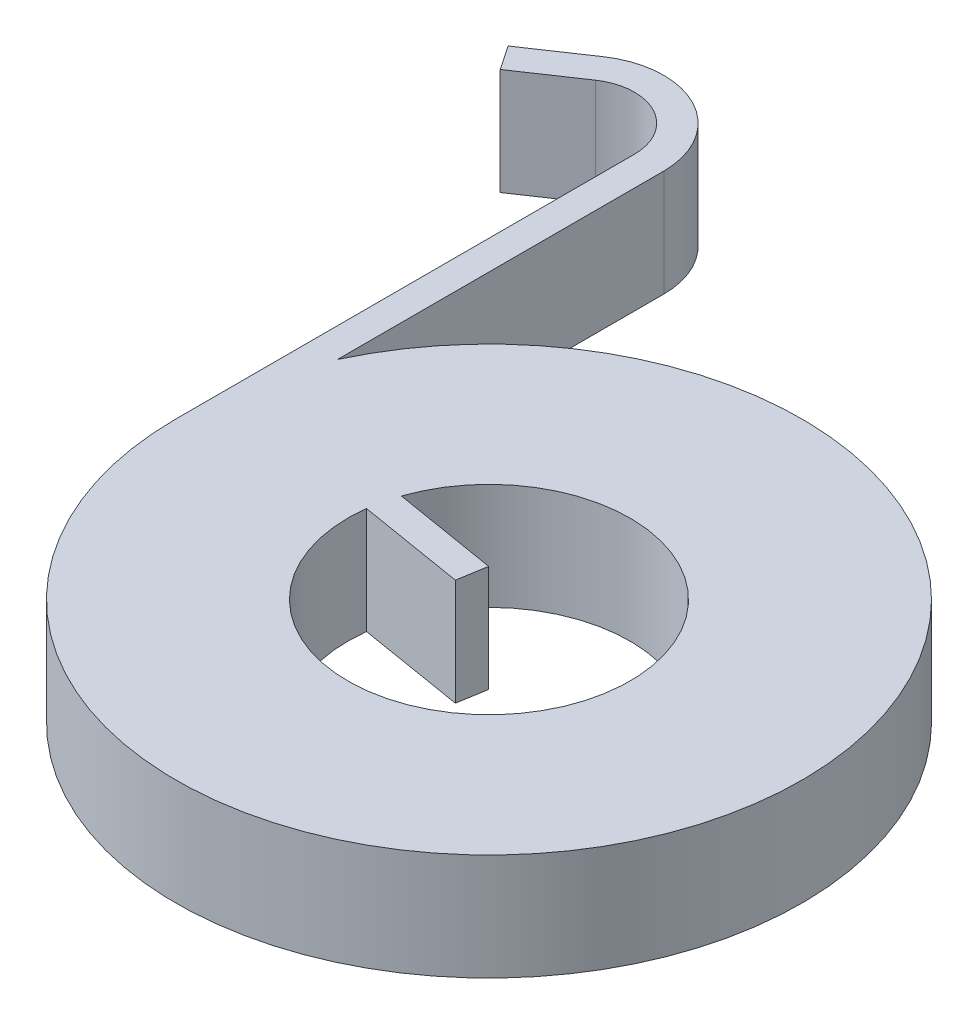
ISO-10303-21;
HEADER;
FILE_DESCRIPTION(('STEP AP214'),'2;1');
FILE_NAME('part.step','',(''),(''),'','','');
FILE_SCHEMA(('AUTOMOTIVE_DESIGN { 1 0 10303 214 1 1 1 1 }'));
ENDSEC;
DATA;
#1=APPLICATION_CONTEXT('core data for automotive mechanical design processes');
#2=APPLICATION_PROTOCOL_DEFINITION('international standard','automotive_design',2000,#1);
#3=PRODUCT_CONTEXT('',#1,'mechanical');
#4=PRODUCT('Part','Part','',(#3));
#5=PRODUCT_RELATED_PRODUCT_CATEGORY('part','',(#4));
#6=PRODUCT_DEFINITION_FORMATION('','',#4);
#7=PRODUCT_DEFINITION_CONTEXT('part definition',#1,'design');
#8=PRODUCT_DEFINITION('design','',#6,#7);
#9=PRODUCT_DEFINITION_SHAPE('','',#8);
#10=(LENGTH_UNIT() NAMED_UNIT(*) SI_UNIT(.MILLI.,.METRE.));
#11=(NAMED_UNIT(*) PLANE_ANGLE_UNIT() SI_UNIT($,.RADIAN.));
#12=(NAMED_UNIT(*) SI_UNIT($,.STERADIAN.) SOLID_ANGLE_UNIT());
#13=UNCERTAINTY_MEASURE_WITH_UNIT(LENGTH_MEASURE(1.E-05),#10,'distance_accuracy_value','');
#14=(GEOMETRIC_REPRESENTATION_CONTEXT(3) GLOBAL_UNCERTAINTY_ASSIGNED_CONTEXT((#13)) GLOBAL_UNIT_ASSIGNED_CONTEXT((#10,
#11,#12)) REPRESENTATION_CONTEXT('',''));
#15=CARTESIAN_POINT('',(0.,0.,0.));
#16=DIRECTION('',(0.,0.,1.));
#17=DIRECTION('',(1.,0.,0.));
#18=AXIS2_PLACEMENT_3D('',#15,#16,#17);
#19=CARTESIAN_POINT('',(0.,15.875,0.));
#20=DIRECTION('',(0.,1.,0.));
#21=DIRECTION('',(0.,0.,1.));
#22=AXIS2_PLACEMENT_3D('',#19,#20,#21);
#23=PLANE('',#22);
#24=CARTESIAN_POINT('',(0.,15.875,0.));
#25=DIRECTION('',(0.,1.,0.));
#26=DIRECTION('',(0.,0.,1.));
#27=AXIS2_PLACEMENT_3D('',#24,#25,#26);
#28=CIRCLE('',#27,46.609);
#29=CARTESIAN_POINT('',(-46.609,15.875,0.));
#30=VERTEX_POINT('',#29);
#31=CARTESIAN_POINT('',(-42.2501498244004,15.875,-19.6805416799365));
#32=VERTEX_POINT('',#31);
#33=EDGE_CURVE('E157',#30,#32,#28,.T.);
#34=ORIENTED_EDGE('',*,*,#33,.T.);
#35=DIRECTION('',(0.,0.,-1.));
#36=VECTOR('',#35,1.);
#37=CARTESIAN_POINT('',(-42.2501498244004,15.875,-68.2851498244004));
#38=LINE('',#37,#36);
#39=CARTESIAN_POINT('',(-42.2501498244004,15.875,-68.2851498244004));
#40=VERTEX_POINT('',#39);
#41=EDGE_CURVE('E160',#32,#40,#38,.T.);
#42=ORIENTED_EDGE('',*,*,#41,.T.);
#43=CARTESIAN_POINT('',(-54.61,15.875,-68.2851498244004));
#44=DIRECTION('',(0.,1.,0.));
#45=DIRECTION('',(0.,0.,-1.));
#46=AXIS2_PLACEMENT_3D('',#43,#44,#45);
#47=CIRCLE('',#46,12.3598501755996);
#48=CARTESIAN_POINT('',(-61.5215405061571,15.875,-78.5319300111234));
#49=VERTEX_POINT('',#48);
#50=EDGE_CURVE('E163',#40,#49,#47,.T.);
#51=ORIENTED_EDGE('',*,*,#50,.T.);
#52=DIRECTION('',(-0.82903757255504,0.,0.55919290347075));
#53=VECTOR('',#52,1.);
#54=CARTESIAN_POINT('',(-61.5215405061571,15.875,-78.5319300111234));
#55=LINE('',#54,#53);
#56=CARTESIAN_POINT('',(-69.977,15.875,-72.8286505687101));
#57=VERTEX_POINT('',#56);
#58=EDGE_CURVE('E165',#49,#57,#55,.T.);
#59=ORIENTED_EDGE('',*,*,#58,.T.);
#60=DIRECTION('',(0.559192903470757,0.,0.829037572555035));
#61=VECTOR('',#60,1.);
#62=CARTESIAN_POINT('',(-67.5395619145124,15.875,-69.215));
#63=LINE('',#62,#61);
#64=CARTESIAN_POINT('',(-67.5395619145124,15.875,-69.215));
#65=VERTEX_POINT('',#64);
#66=EDGE_CURVE('E167',#57,#65,#63,.T.);
#67=ORIENTED_EDGE('',*,*,#66,.T.);
#68=DIRECTION('',(0.829037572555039,0.,-0.559192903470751));
#69=VECTOR('',#68,1.);
#70=CARTESIAN_POINT('',(-59.0841024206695,15.875,-74.9182794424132));
#71=LINE('',#70,#69);
#72=CARTESIAN_POINT('',(-59.0841024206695,15.875,-74.9182794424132));
#73=VERTEX_POINT('',#72);
#74=EDGE_CURVE('E169',#65,#73,#71,.T.);
#75=ORIENTED_EDGE('',*,*,#74,.T.);
#76=CARTESIAN_POINT('',(-54.61,15.875,-68.2851498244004));
#77=DIRECTION('',(0.,-1.,0.));
#78=DIRECTION('',(0.,0.,1.));
#79=AXIS2_PLACEMENT_3D('',#76,#77,#78);
#80=CIRCLE('',#79,8.001);
#81=CARTESIAN_POINT('',(-46.609,15.875,-68.2851498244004));
#82=VERTEX_POINT('',#81);
#83=EDGE_CURVE('E171',#73,#82,#80,.T.);
#84=ORIENTED_EDGE('',*,*,#83,.T.);
#85=DIRECTION('',(0.,0.,1.));
#86=VECTOR('',#85,1.);
#87=CARTESIAN_POINT('',(-46.609,15.875,0.));
#88=LINE('',#87,#86);
#89=EDGE_CURVE('E173',#82,#30,#88,.T.);
#90=ORIENTED_EDGE('',*,*,#89,.T.);
#91=EDGE_LOOP('',(#34,#42,#51,#59,#67,#75,#84,#90));
#92=FACE_BOUND('',#91,.T.);
#93=DIRECTION('',(0.98664272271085,0.,0.162899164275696));
#94=VECTOR('',#93,1.);
#95=CARTESIAN_POINT('',(-19.881308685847,15.875,-6.83280135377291));
#96=LINE('',#95,#94);
#97=CARTESIAN_POINT('',(-19.881308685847,15.875,-6.83280135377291));
#98=VERTEX_POINT('',#97);
#99=CARTESIAN_POINT('',(-4.30040140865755,15.875,-4.26032327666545));
#100=VERTEX_POINT('',#99);
#101=EDGE_CURVE('E129',#98,#100,#96,.T.);
#102=ORIENTED_EDGE('',*,*,#101,.F.);
#103=CARTESIAN_POINT('',(0.,15.875,0.));
#104=DIRECTION('',(0.,1.,0.));
#105=DIRECTION('',(0.,0.,1.));
#106=AXIS2_PLACEMENT_3D('',#103,#104,#105);
#107=CIRCLE('',#106,21.0226927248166);
#108=CARTESIAN_POINT('',(-20.8590712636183,15.875,-2.61777680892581));
#109=VERTEX_POINT('',#108);
#110=EDGE_CURVE('E121',#109,#98,#107,.T.);
#111=ORIENTED_EDGE('',*,*,#110,.F.);
#112=DIRECTION('',(-0.98664272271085,0.,-0.162899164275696));
#113=VECTOR('',#112,1.);
#114=CARTESIAN_POINT('',(-20.8590712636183,15.875,-2.61777680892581));
#115=LINE('',#114,#113);
#116=CARTESIAN_POINT('',(-5.00380000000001,15.875,0.));
#117=VERTEX_POINT('',#116);
#118=EDGE_CURVE('E143',#117,#109,#115,.T.);
#119=ORIENTED_EDGE('',*,*,#118,.F.);
#120=DIRECTION('',(-0.162899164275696,0.,0.98664272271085));
#121=VECTOR('',#120,1.);
#122=CARTESIAN_POINT('',(-5.00380000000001,15.875,0.));
#123=LINE('',#122,#121);
#124=EDGE_CURVE('E141',#100,#117,#123,.T.);
#125=ORIENTED_EDGE('',*,*,#124,.F.);
#126=EDGE_LOOP('',(#102,#111,#119,#125));
#127=FACE_BOUND('',#126,.T.);
#128=ADVANCED_FACE('F32',(#92,#127),#23,.T.);
#129=CARTESIAN_POINT('',(0.,0.,0.));
#130=DIRECTION('',(0.,1.,0.));
#131=DIRECTION('',(0.,0.,1.));
#132=AXIS2_PLACEMENT_3D('',#129,#130,#131);
#133=PLANE('',#132);
#134=CARTESIAN_POINT('',(0.,0.,0.));
#135=DIRECTION('',(0.,1.,0.));
#136=DIRECTION('',(0.,0.,1.));
#137=AXIS2_PLACEMENT_3D('',#134,#135,#136);
#138=CIRCLE('',#137,46.609);
#139=CARTESIAN_POINT('',(-46.609,0.,0.));
#140=VERTEX_POINT('',#139);
#141=CARTESIAN_POINT('',(-42.2501498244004,0.,-19.6805416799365));
#142=VERTEX_POINT('',#141);
#143=EDGE_CURVE('E137',#140,#142,#138,.T.);
#144=ORIENTED_EDGE('',*,*,#143,.F.);
#145=DIRECTION('',(0.,0.,1.));
#146=VECTOR('',#145,1.);
#147=CARTESIAN_POINT('',(-46.609,0.,0.));
#148=LINE('',#147,#146);
#149=CARTESIAN_POINT('',(-46.609,0.,-68.2851498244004));
#150=VERTEX_POINT('',#149);
#151=EDGE_CURVE('E161',#150,#140,#148,.T.);
#152=ORIENTED_EDGE('',*,*,#151,.F.);
#153=CARTESIAN_POINT('',(-54.61,0.,-68.2851498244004));
#154=DIRECTION('',(0.,-1.,0.));
#155=DIRECTION('',(0.,0.,1.));
#156=AXIS2_PLACEMENT_3D('',#153,#154,#155);
#157=CIRCLE('',#156,8.001);
#158=CARTESIAN_POINT('',(-59.0841024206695,0.,-74.9182794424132));
#159=VERTEX_POINT('',#158);
#160=EDGE_CURVE('E188',#159,#150,#157,.T.);
#161=ORIENTED_EDGE('',*,*,#160,.F.);
#162=DIRECTION('',(0.829037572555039,0.,-0.559192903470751));
#163=VECTOR('',#162,1.);
#164=CARTESIAN_POINT('',(-59.0841024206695,0.,-74.9182794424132));
#165=LINE('',#164,#163);
#166=CARTESIAN_POINT('',(-67.5395619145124,0.,-69.215));
#167=VERTEX_POINT('',#166);
#168=EDGE_CURVE('E186',#167,#159,#165,.T.);
#169=ORIENTED_EDGE('',*,*,#168,.F.);
#170=DIRECTION('',(0.559192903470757,0.,0.829037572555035));
#171=VECTOR('',#170,1.);
#172=CARTESIAN_POINT('',(-67.5395619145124,0.,-69.215));
#173=LINE('',#172,#171);
#174=CARTESIAN_POINT('',(-69.977,0.,-72.8286505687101));
#175=VERTEX_POINT('',#174);
#176=EDGE_CURVE('E184',#175,#167,#173,.T.);
#177=ORIENTED_EDGE('',*,*,#176,.F.);
#178=DIRECTION('',(-0.82903757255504,0.,0.55919290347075));
#179=VECTOR('',#178,1.);
#180=CARTESIAN_POINT('',(-61.5215405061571,0.,-78.5319300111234));
#181=LINE('',#180,#179);
#182=CARTESIAN_POINT('',(-61.5215405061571,0.,-78.5319300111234));
#183=VERTEX_POINT('',#182);
#184=EDGE_CURVE('E182',#183,#175,#181,.T.);
#185=ORIENTED_EDGE('',*,*,#184,.F.);
#186=CARTESIAN_POINT('',(-54.61,0.,-68.2851498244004));
#187=DIRECTION('',(0.,1.,0.));
#188=DIRECTION('',(0.,0.,-1.));
#189=AXIS2_PLACEMENT_3D('',#186,#187,#188);
#190=CIRCLE('',#189,12.3598501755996);
#191=CARTESIAN_POINT('',(-42.2501498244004,0.,-68.2851498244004));
#192=VERTEX_POINT('',#191);
#193=EDGE_CURVE('E180',#192,#183,#190,.T.);
#194=ORIENTED_EDGE('',*,*,#193,.F.);
#195=DIRECTION('',(0.,0.,-1.));
#196=VECTOR('',#195,1.);
#197=CARTESIAN_POINT('',(-42.2501498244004,0.,-68.2851498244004));
#198=LINE('',#197,#196);
#199=EDGE_CURVE('E178',#142,#192,#198,.T.);
#200=ORIENTED_EDGE('',*,*,#199,.F.);
#201=EDGE_LOOP('',(#144,#152,#161,#169,#177,#185,#194,#200));
#202=FACE_BOUND('',#201,.T.);
#203=CARTESIAN_POINT('',(0.,0.,0.));
#204=DIRECTION('',(0.,1.,0.));
#205=DIRECTION('',(0.,0.,1.));
#206=AXIS2_PLACEMENT_3D('',#203,#204,#205);
#207=CIRCLE('',#206,21.0226927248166);
#208=CARTESIAN_POINT('',(-20.8590712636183,0.,-2.61777680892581));
#209=VERTEX_POINT('',#208);
#210=CARTESIAN_POINT('',(-19.881308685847,0.,-6.83280135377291));
#211=VERTEX_POINT('',#210);
#212=EDGE_CURVE('E55',#209,#211,#207,.T.);
#213=ORIENTED_EDGE('',*,*,#212,.T.);
#214=DIRECTION('',(0.98664272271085,0.,0.162899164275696));
#215=VECTOR('',#214,1.);
#216=CARTESIAN_POINT('',(-19.881308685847,0.,-6.83280135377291));
#217=LINE('',#216,#215);
#218=CARTESIAN_POINT('',(-4.30040140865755,0.,-4.26032327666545));
#219=VERTEX_POINT('',#218);
#220=EDGE_CURVE('E136',#211,#219,#217,.T.);
#221=ORIENTED_EDGE('',*,*,#220,.T.);
#222=DIRECTION('',(-0.162899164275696,0.,0.98664272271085));
#223=VECTOR('',#222,1.);
#224=CARTESIAN_POINT('',(-5.00380000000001,0.,0.));
#225=LINE('',#224,#223);
#226=CARTESIAN_POINT('',(-5.00380000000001,0.,0.));
#227=VERTEX_POINT('',#226);
#228=EDGE_CURVE('E149',#219,#227,#225,.T.);
#229=ORIENTED_EDGE('',*,*,#228,.T.);
#230=DIRECTION('',(-0.98664272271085,0.,-0.162899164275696));
#231=VECTOR('',#230,1.);
#232=CARTESIAN_POINT('',(-20.8590712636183,0.,-2.61777680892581));
#233=LINE('',#232,#231);
#234=EDGE_CURVE('E130',#227,#209,#233,.T.);
#235=ORIENTED_EDGE('',*,*,#234,.T.);
#236=EDGE_LOOP('',(#213,#221,#229,#235));
#237=FACE_BOUND('',#236,.T.);
#238=ADVANCED_FACE('F218',(#202,#237),#133,.F.);
#239=CARTESIAN_POINT('',(0.,15.875,0.));
#240=DIRECTION('',(0.,-1.,0.));
#241=DIRECTION('',(0.,0.,-1.));
#242=AXIS2_PLACEMENT_3D('',#239,#240,#241);
#243=CYLINDRICAL_SURFACE('',#242,46.609);
#244=ORIENTED_EDGE('',*,*,#143,.T.);
#245=DIRECTION('',(0.,-1.,0.));
#246=VECTOR('',#245,1.);
#247=CARTESIAN_POINT('',(-42.2501498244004,15.875,-19.6805416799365));
#248=LINE('',#247,#246);
#249=EDGE_CURVE('E11',#32,#142,#248,.T.);
#250=ORIENTED_EDGE('',*,*,#249,.F.);
#251=ORIENTED_EDGE('',*,*,#33,.F.);
#252=DIRECTION('',(0.,-1.,0.));
#253=VECTOR('',#252,1.);
#254=CARTESIAN_POINT('',(-46.609,15.875,0.));
#255=LINE('',#254,#253);
#256=EDGE_CURVE('E175',#30,#140,#255,.T.);
#257=ORIENTED_EDGE('',*,*,#256,.T.);
#258=EDGE_LOOP('',(#244,#250,#251,#257));
#259=FACE_BOUND('',#258,.T.);
#260=ADVANCED_FACE('F34',(#259),#243,.T.);
#261=CARTESIAN_POINT('',(-42.2501498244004,15.875,-68.2851498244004));
#262=DIRECTION('',(-1.,0.,0.));
#263=DIRECTION('',(0.,0.,1.));
#264=AXIS2_PLACEMENT_3D('',#261,#262,#263);
#265=PLANE('',#264);
#266=ORIENTED_EDGE('',*,*,#199,.T.);
#267=DIRECTION('',(0.,-1.,0.));
#268=VECTOR('',#267,1.);
#269=CARTESIAN_POINT('',(-42.2501498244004,15.875,-68.2851498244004));
#270=LINE('',#269,#268);
#271=EDGE_CURVE('E40',#40,#192,#270,.T.);
#272=ORIENTED_EDGE('',*,*,#271,.F.);
#273=ORIENTED_EDGE('',*,*,#41,.F.);
#274=ORIENTED_EDGE('',*,*,#249,.T.);
#275=EDGE_LOOP('',(#266,#272,#273,#274));
#276=FACE_BOUND('',#275,.T.);
#277=ADVANCED_FACE('F235',(#276),#265,.F.);
#278=CARTESIAN_POINT('',(-54.61,15.875,-68.2851498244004));
#279=DIRECTION('',(0.,-1.,0.));
#280=DIRECTION('',(0.,0.,-1.));
#281=AXIS2_PLACEMENT_3D('',#278,#279,#280);
#282=CYLINDRICAL_SURFACE('',#281,12.3598501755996);
#283=ORIENTED_EDGE('',*,*,#193,.T.);
#284=DIRECTION('',(0.,-1.,0.));
#285=VECTOR('',#284,1.);
#286=CARTESIAN_POINT('',(-61.5215405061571,15.875,-78.5319300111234));
#287=LINE('',#286,#285);
#288=EDGE_CURVE('E205',#49,#183,#287,.T.);
#289=ORIENTED_EDGE('',*,*,#288,.F.);
#290=ORIENTED_EDGE('',*,*,#50,.F.);
#291=ORIENTED_EDGE('',*,*,#271,.T.);
#292=EDGE_LOOP('',(#283,#289,#290,#291));
#293=FACE_BOUND('',#292,.T.);
#294=ADVANCED_FACE('F212',(#293),#282,.T.);
#295=CARTESIAN_POINT('',(-61.5215405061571,15.875,-78.5319300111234));
#296=DIRECTION('',(0.55919290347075,0.,0.82903757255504));
#297=DIRECTION('',(0.82903757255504,0.,-0.55919290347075));
#298=AXIS2_PLACEMENT_3D('',#295,#296,#297);
#299=PLANE('',#298);
#300=ORIENTED_EDGE('',*,*,#184,.T.);
#301=DIRECTION('',(0.,-1.,0.));
#302=VECTOR('',#301,1.);
#303=CARTESIAN_POINT('',(-69.977,15.875,-72.8286505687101));
#304=LINE('',#303,#302);
#305=EDGE_CURVE('E202',#57,#175,#304,.T.);
#306=ORIENTED_EDGE('',*,*,#305,.F.);
#307=ORIENTED_EDGE('',*,*,#58,.F.);
#308=ORIENTED_EDGE('',*,*,#288,.T.);
#309=EDGE_LOOP('',(#300,#306,#307,#308));
#310=FACE_BOUND('',#309,.T.);
#311=ADVANCED_FACE('F224',(#310),#299,.F.);
#312=CARTESIAN_POINT('',(-67.5395619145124,15.875,-69.215));
#313=DIRECTION('',(0.829037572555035,0.,-0.559192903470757));
#314=DIRECTION('',(-0.559192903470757,0.,-0.829037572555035));
#315=AXIS2_PLACEMENT_3D('',#312,#313,#314);
#316=PLANE('',#315);
#317=ORIENTED_EDGE('',*,*,#176,.T.);
#318=DIRECTION('',(0.,-1.,0.));
#319=VECTOR('',#318,1.);
#320=CARTESIAN_POINT('',(-67.5395619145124,15.875,-69.215));
#321=LINE('',#320,#319);
#322=EDGE_CURVE('E199',#65,#167,#321,.T.);
#323=ORIENTED_EDGE('',*,*,#322,.F.);
#324=ORIENTED_EDGE('',*,*,#66,.F.);
#325=ORIENTED_EDGE('',*,*,#305,.T.);
#326=EDGE_LOOP('',(#317,#323,#324,#325));
#327=FACE_BOUND('',#326,.T.);
#328=ADVANCED_FACE('F228',(#327),#316,.F.);
#329=CARTESIAN_POINT('',(-59.0841024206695,15.875,-74.9182794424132));
#330=DIRECTION('',(-0.559192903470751,0.,-0.829037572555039));
#331=DIRECTION('',(-0.829037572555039,0.,0.559192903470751));
#332=AXIS2_PLACEMENT_3D('',#329,#330,#331);
#333=PLANE('',#332);
#334=ORIENTED_EDGE('',*,*,#168,.T.);
#335=DIRECTION('',(0.,-1.,0.));
#336=VECTOR('',#335,1.);
#337=CARTESIAN_POINT('',(-59.0841024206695,15.875,-74.9182794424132));
#338=LINE('',#337,#336);
#339=EDGE_CURVE('E196',#73,#159,#338,.T.);
#340=ORIENTED_EDGE('',*,*,#339,.F.);
#341=ORIENTED_EDGE('',*,*,#74,.F.);
#342=ORIENTED_EDGE('',*,*,#322,.T.);
#343=EDGE_LOOP('',(#334,#340,#341,#342));
#344=FACE_BOUND('',#343,.T.);
#345=ADVANCED_FACE('F248',(#344),#333,.F.);
#346=CARTESIAN_POINT('',(-54.61,15.875,-68.2851498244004));
#347=DIRECTION('',(0.,-1.,0.));
#348=DIRECTION('',(0.,0.,-1.));
#349=AXIS2_PLACEMENT_3D('',#346,#347,#348);
#350=CYLINDRICAL_SURFACE('',#349,8.001);
#351=ORIENTED_EDGE('',*,*,#160,.T.);
#352=DIRECTION('',(0.,-1.,0.));
#353=VECTOR('',#352,1.);
#354=CARTESIAN_POINT('',(-46.609,15.875,-68.2851498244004));
#355=LINE('',#354,#353);
#356=EDGE_CURVE('E193',#82,#150,#355,.T.);
#357=ORIENTED_EDGE('',*,*,#356,.F.);
#358=ORIENTED_EDGE('',*,*,#83,.F.);
#359=ORIENTED_EDGE('',*,*,#339,.T.);
#360=EDGE_LOOP('',(#351,#357,#358,#359));
#361=FACE_BOUND('',#360,.T.);
#362=ADVANCED_FACE('F246',(#361),#350,.F.);
#363=CARTESIAN_POINT('',(-46.609,15.875,0.));
#364=DIRECTION('',(1.,0.,0.));
#365=DIRECTION('',(0.,0.,-1.));
#366=AXIS2_PLACEMENT_3D('',#363,#364,#365);
#367=PLANE('',#366);
#368=ORIENTED_EDGE('',*,*,#151,.T.);
#369=ORIENTED_EDGE('',*,*,#256,.F.);
#370=ORIENTED_EDGE('',*,*,#89,.F.);
#371=ORIENTED_EDGE('',*,*,#356,.T.);
#372=EDGE_LOOP('',(#368,#369,#370,#371));
#373=FACE_BOUND('',#372,.T.);
#374=ADVANCED_FACE('F241',(#373),#367,.F.);
#375=CARTESIAN_POINT('',(0.,15.875,0.));
#376=DIRECTION('',(0.,-1.,0.));
#377=DIRECTION('',(0.,0.,-1.));
#378=AXIS2_PLACEMENT_3D('',#375,#376,#377);
#379=CYLINDRICAL_SURFACE('',#378,21.0226927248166);
#380=ORIENTED_EDGE('',*,*,#212,.F.);
#381=DIRECTION('',(0.,-1.,0.));
#382=VECTOR('',#381,1.);
#383=CARTESIAN_POINT('',(-20.8590712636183,15.875,-2.61777680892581));
#384=LINE('',#383,#382);
#385=EDGE_CURVE('E125',#109,#209,#384,.T.);
#386=ORIENTED_EDGE('',*,*,#385,.F.);
#387=ORIENTED_EDGE('',*,*,#110,.T.);
#388=DIRECTION('',(0.,-1.,0.));
#389=VECTOR('',#388,1.);
#390=CARTESIAN_POINT('',(-19.881308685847,15.875,-6.83280135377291));
#391=LINE('',#390,#389);
#392=EDGE_CURVE('E124',#98,#211,#391,.T.);
#393=ORIENTED_EDGE('',*,*,#392,.T.);
#394=EDGE_LOOP('',(#380,#386,#387,#393));
#395=FACE_BOUND('',#394,.T.);
#396=ADVANCED_FACE('F123',(#395),#379,.F.);
#397=CARTESIAN_POINT('',(-19.881308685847,15.875,-6.83280135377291));
#398=DIRECTION('',(0.162899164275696,0.,-0.98664272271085));
#399=DIRECTION('',(-0.98664272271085,0.,-0.162899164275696));
#400=AXIS2_PLACEMENT_3D('',#397,#398,#399);
#401=PLANE('',#400);
#402=ORIENTED_EDGE('',*,*,#220,.F.);
#403=ORIENTED_EDGE('',*,*,#392,.F.);
#404=ORIENTED_EDGE('',*,*,#101,.T.);
#405=DIRECTION('',(0.,-1.,0.));
#406=VECTOR('',#405,1.);
#407=CARTESIAN_POINT('',(-4.30040140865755,15.875,-4.26032327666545));
#408=LINE('',#407,#406);
#409=EDGE_CURVE('E138',#100,#219,#408,.T.);
#410=ORIENTED_EDGE('',*,*,#409,.T.);
#411=EDGE_LOOP('',(#402,#403,#404,#410));
#412=FACE_BOUND('',#411,.T.);
#413=ADVANCED_FACE('F133',(#412),#401,.T.);
#414=CARTESIAN_POINT('',(-5.00380000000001,15.875,0.));
#415=DIRECTION('',(0.98664272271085,0.,0.162899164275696));
#416=DIRECTION('',(0.162899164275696,0.,-0.98664272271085));
#417=AXIS2_PLACEMENT_3D('',#414,#415,#416);
#418=PLANE('',#417);
#419=ORIENTED_EDGE('',*,*,#228,.F.);
#420=ORIENTED_EDGE('',*,*,#409,.F.);
#421=ORIENTED_EDGE('',*,*,#124,.T.);
#422=DIRECTION('',(0.,-1.,0.));
#423=VECTOR('',#422,1.);
#424=CARTESIAN_POINT('',(-5.00380000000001,15.875,0.));
#425=LINE('',#424,#423);
#426=EDGE_CURVE('E47',#117,#227,#425,.T.);
#427=ORIENTED_EDGE('',*,*,#426,.T.);
#428=EDGE_LOOP('',(#419,#420,#421,#427));
#429=FACE_BOUND('',#428,.T.);
#430=ADVANCED_FACE('F273',(#429),#418,.T.);
#431=CARTESIAN_POINT('',(-20.8590712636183,15.875,-2.61777680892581));
#432=DIRECTION('',(-0.162899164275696,0.,0.98664272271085));
#433=DIRECTION('',(0.98664272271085,0.,0.162899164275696));
#434=AXIS2_PLACEMENT_3D('',#431,#432,#433);
#435=PLANE('',#434);
#436=ORIENTED_EDGE('',*,*,#234,.F.);
#437=ORIENTED_EDGE('',*,*,#426,.F.);
#438=ORIENTED_EDGE('',*,*,#118,.T.);
#439=ORIENTED_EDGE('',*,*,#385,.T.);
#440=EDGE_LOOP('',(#436,#437,#438,#439));
#441=FACE_BOUND('',#440,.T.);
#442=ADVANCED_FACE('F277',(#441),#435,.T.);
#443=CLOSED_SHELL('',(#128,#238,#260,#277,#294,#311,#328,#345,#362,#374,#396,#413,#430,#442));
#444=MANIFOLD_SOLID_BREP('B2',#443);
#445=ADVANCED_BREP_SHAPE_REPRESENTATION('',(#18,#444),#14);
#446=SHAPE_DEFINITION_REPRESENTATION(#9,#445);
ENDSEC;
END-ISO-10303-21;
